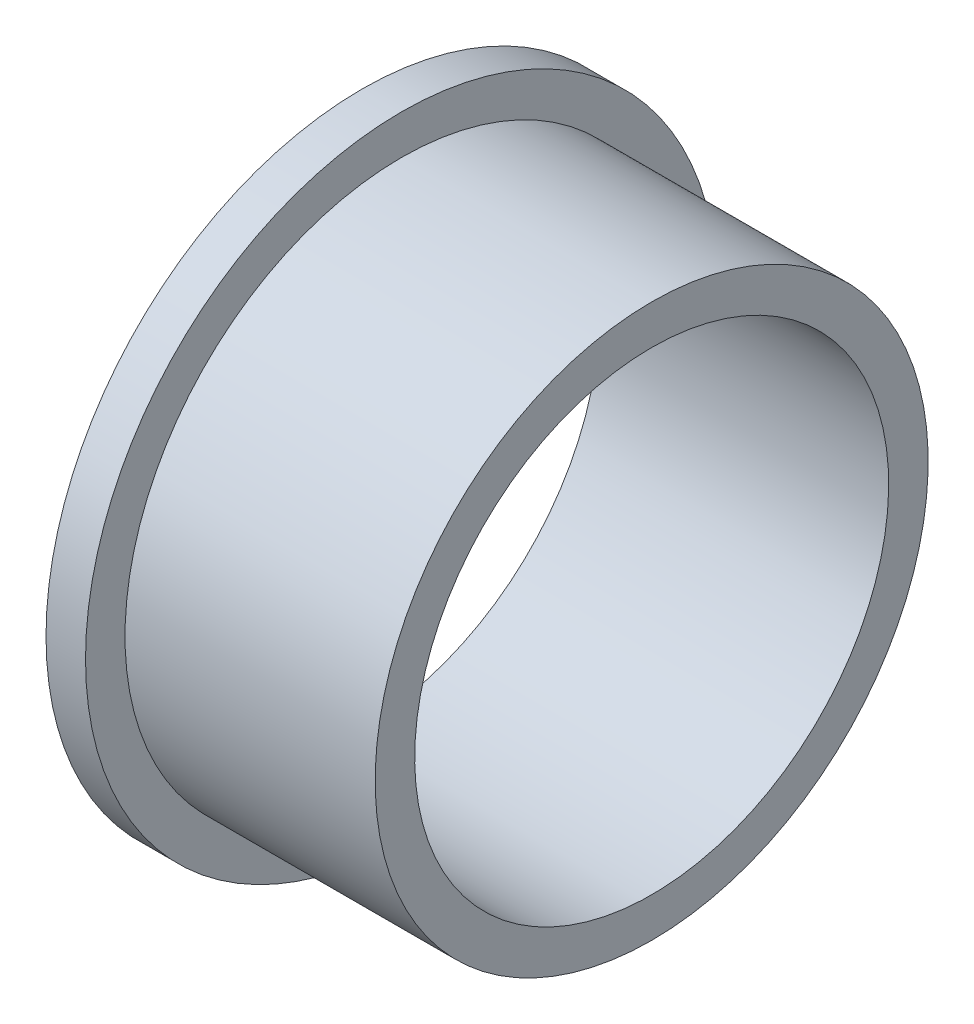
from build123d import *


with BuildPart() as part:
    # Schizzo1 → Rivoluzione1 (revolve)
    with BuildSketch(Plane.XY):
        Polygon((-22, 18), (-22, 24), (-19, 24), (-19, 21), (0, 21), (0, 18), align=None)
    revolve(axis=Axis((0, 0, 0), (-1, 0, 0)))


solid = part.part
